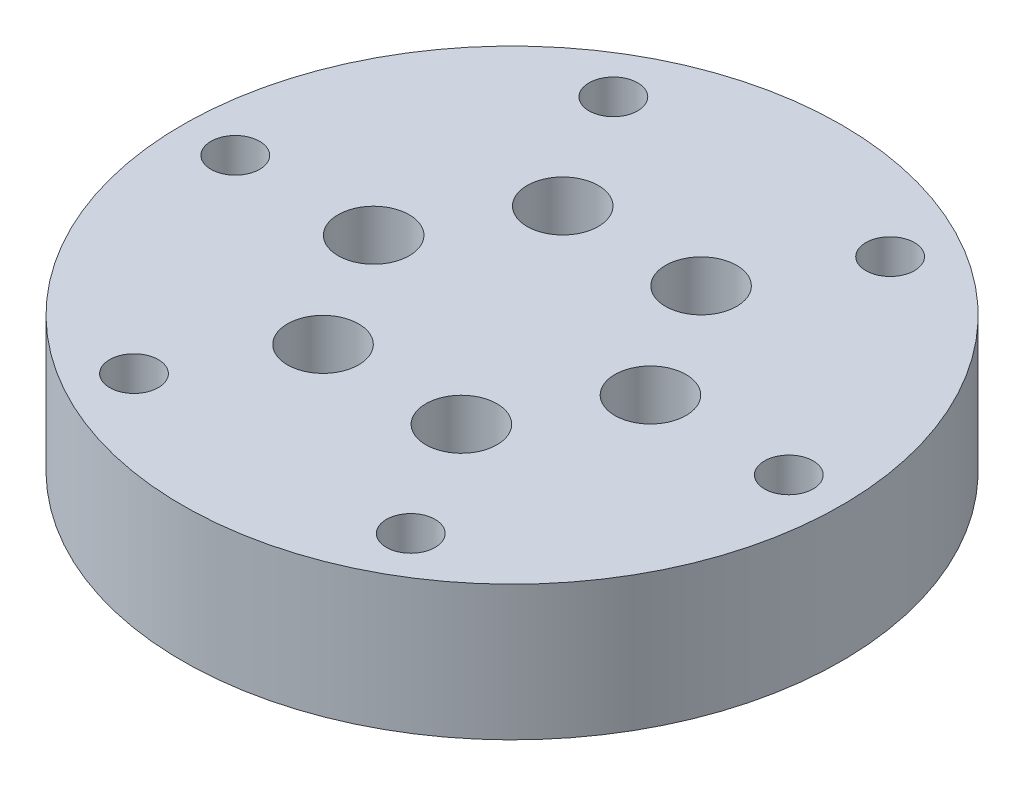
ISO-10303-21;
HEADER;
FILE_DESCRIPTION(('STEP AP214'),'2;1');
FILE_NAME('part.step','',(''),(''),'','','');
FILE_SCHEMA(('AUTOMOTIVE_DESIGN { 1 0 10303 214 1 1 1 1 }'));
ENDSEC;
DATA;
#1=APPLICATION_CONTEXT('core data for automotive mechanical design processes');
#2=APPLICATION_PROTOCOL_DEFINITION('international standard','automotive_design',2000,#1);
#3=PRODUCT_CONTEXT('',#1,'mechanical');
#4=PRODUCT('Part','Part','',(#3));
#5=PRODUCT_RELATED_PRODUCT_CATEGORY('part','',(#4));
#6=PRODUCT_DEFINITION_FORMATION('','',#4);
#7=PRODUCT_DEFINITION_CONTEXT('part definition',#1,'design');
#8=PRODUCT_DEFINITION('design','',#6,#7);
#9=PRODUCT_DEFINITION_SHAPE('','',#8);
#10=(LENGTH_UNIT() NAMED_UNIT(*) SI_UNIT(.MILLI.,.METRE.));
#11=(NAMED_UNIT(*) PLANE_ANGLE_UNIT() SI_UNIT($,.RADIAN.));
#12=(NAMED_UNIT(*) SI_UNIT($,.STERADIAN.) SOLID_ANGLE_UNIT());
#13=UNCERTAINTY_MEASURE_WITH_UNIT(LENGTH_MEASURE(1.E-05),#10,'distance_accuracy_value','');
#14=(GEOMETRIC_REPRESENTATION_CONTEXT(3) GLOBAL_UNCERTAINTY_ASSIGNED_CONTEXT((#13)) GLOBAL_UNIT_ASSIGNED_CONTEXT((#10,
#11,#12)) REPRESENTATION_CONTEXT('',''));
#15=CARTESIAN_POINT('',(0.,0.,0.));
#16=DIRECTION('',(0.,0.,1.));
#17=DIRECTION('',(1.,0.,0.));
#18=AXIS2_PLACEMENT_3D('',#15,#16,#17);
#19=CARTESIAN_POINT('',(29.329393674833,109.652959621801,50.8));
#20=DIRECTION('',(0.,1.,0.));
#21=DIRECTION('',(0.,0.,1.));
#22=AXIS2_PLACEMENT_3D('',#19,#20,#21);
#23=CYLINDRICAL_SURFACE('',#22,9.92187500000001);
#24=CARTESIAN_POINT('',(29.329393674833,137.716260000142,50.8));
#25=DIRECTION('',(0.,-1.,0.));
#26=DIRECTION('',(0.,0.,-1.));
#27=AXIS2_PLACEMENT_3D('',#24,#25,#26);
#28=CIRCLE('',#27,9.92187500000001);
#29=CARTESIAN_POINT('',(29.329393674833,137.716260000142,40.878125));
#30=VERTEX_POINT('',#29);
#31=EDGE_CURVE('E108',#30,#30,#28,.F.);
#32=ORIENTED_EDGE('',*,*,#31,.F.);
#33=EDGE_LOOP('',(#32));
#34=FACE_BOUND('',#33,.T.);
#35=CARTESIAN_POINT('',(29.329393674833,166.291260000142,50.8));
#36=DIRECTION('',(0.,1.,0.));
#37=DIRECTION('',(0.,0.,1.));
#38=AXIS2_PLACEMENT_3D('',#35,#36,#37);
#39=CIRCLE('',#38,9.92187500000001);
#40=CARTESIAN_POINT('',(29.329393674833,166.291260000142,60.721875));
#41=VERTEX_POINT('',#40);
#42=EDGE_CURVE('E41',#41,#41,#39,.F.);
#43=ORIENTED_EDGE('',*,*,#42,.F.);
#44=EDGE_LOOP('',(#43));
#45=FACE_BOUND('',#44,.T.);
#46=ADVANCED_FACE('F37',(#34,#45),#23,.F.);
#47=CARTESIAN_POINT('',(-29.329393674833,109.652959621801,50.8));
#48=DIRECTION('',(0.,1.,0.));
#49=DIRECTION('',(0.,0.,1.));
#50=AXIS2_PLACEMENT_3D('',#47,#48,#49);
#51=CYLINDRICAL_SURFACE('',#50,9.921875);
#52=CARTESIAN_POINT('',(-29.329393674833,137.716260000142,50.8));
#53=DIRECTION('',(0.,-1.,0.));
#54=DIRECTION('',(0.,0.,-1.));
#55=AXIS2_PLACEMENT_3D('',#52,#53,#54);
#56=CIRCLE('',#55,9.921875);
#57=CARTESIAN_POINT('',(-29.329393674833,137.716260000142,40.878125));
#58=VERTEX_POINT('',#57);
#59=EDGE_CURVE('E114',#58,#58,#56,.F.);
#60=ORIENTED_EDGE('',*,*,#59,.F.);
#61=EDGE_LOOP('',(#60));
#62=FACE_BOUND('',#61,.T.);
#63=CARTESIAN_POINT('',(-29.329393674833,166.291260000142,50.8));
#64=DIRECTION('',(0.,1.,0.));
#65=DIRECTION('',(0.,0.,1.));
#66=AXIS2_PLACEMENT_3D('',#63,#64,#65);
#67=CIRCLE('',#66,9.921875);
#68=CARTESIAN_POINT('',(-29.329393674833,166.291260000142,60.721875));
#69=VERTEX_POINT('',#68);
#70=EDGE_CURVE('E66',#69,#69,#67,.F.);
#71=ORIENTED_EDGE('',*,*,#70,.F.);
#72=EDGE_LOOP('',(#71));
#73=FACE_BOUND('',#72,.T.);
#74=ADVANCED_FACE('F181',(#62,#73),#51,.F.);
#75=CARTESIAN_POINT('',(-29.329393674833,109.652959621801,-50.8));
#76=DIRECTION('',(0.,1.,0.));
#77=DIRECTION('',(0.,0.,1.));
#78=AXIS2_PLACEMENT_3D('',#75,#76,#77);
#79=CYLINDRICAL_SURFACE('',#78,9.921875);
#80=CARTESIAN_POINT('',(-29.329393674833,137.716260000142,-50.8));
#81=DIRECTION('',(0.,-1.,0.));
#82=DIRECTION('',(0.,0.,-1.));
#83=AXIS2_PLACEMENT_3D('',#80,#81,#82);
#84=CIRCLE('',#83,9.921875);
#85=CARTESIAN_POINT('',(-29.329393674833,137.716260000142,-60.721875));
#86=VERTEX_POINT('',#85);
#87=EDGE_CURVE('E117',#86,#86,#84,.F.);
#88=ORIENTED_EDGE('',*,*,#87,.F.);
#89=EDGE_LOOP('',(#88));
#90=FACE_BOUND('',#89,.T.);
#91=CARTESIAN_POINT('',(-29.329393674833,166.291260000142,-50.8));
#92=DIRECTION('',(0.,1.,0.));
#93=DIRECTION('',(0.,0.,1.));
#94=AXIS2_PLACEMENT_3D('',#91,#92,#93);
#95=CIRCLE('',#94,9.921875);
#96=CARTESIAN_POINT('',(-29.329393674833,166.291260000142,-40.878125));
#97=VERTEX_POINT('',#96);
#98=EDGE_CURVE('E64',#97,#97,#95,.F.);
#99=ORIENTED_EDGE('',*,*,#98,.F.);
#100=EDGE_LOOP('',(#99));
#101=FACE_BOUND('',#100,.T.);
#102=ADVANCED_FACE('F187',(#90,#101),#79,.F.);
#103=CARTESIAN_POINT('',(-58.658787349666,109.652959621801,0.));
#104=DIRECTION('',(0.,1.,0.));
#105=DIRECTION('',(0.,0.,1.));
#106=AXIS2_PLACEMENT_3D('',#103,#104,#105);
#107=CYLINDRICAL_SURFACE('',#106,9.921875);
#108=CARTESIAN_POINT('',(-58.658787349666,137.716260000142,0.));
#109=DIRECTION('',(0.,-1.,0.));
#110=DIRECTION('',(0.,0.,-1.));
#111=AXIS2_PLACEMENT_3D('',#108,#109,#110);
#112=CIRCLE('',#111,9.921875);
#113=CARTESIAN_POINT('',(-58.658787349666,137.716260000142,-9.92187500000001));
#114=VERTEX_POINT('',#113);
#115=EDGE_CURVE('E111',#114,#114,#112,.F.);
#116=ORIENTED_EDGE('',*,*,#115,.F.);
#117=EDGE_LOOP('',(#116));
#118=FACE_BOUND('',#117,.T.);
#119=CARTESIAN_POINT('',(-58.658787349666,166.291260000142,0.));
#120=DIRECTION('',(0.,1.,0.));
#121=DIRECTION('',(0.,0.,1.));
#122=AXIS2_PLACEMENT_3D('',#119,#120,#121);
#123=CIRCLE('',#122,9.921875);
#124=CARTESIAN_POINT('',(-58.658787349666,166.291260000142,9.921875));
#125=VERTEX_POINT('',#124);
#126=EDGE_CURVE('E61',#125,#125,#123,.F.);
#127=ORIENTED_EDGE('',*,*,#126,.F.);
#128=EDGE_LOOP('',(#127));
#129=FACE_BOUND('',#128,.T.);
#130=ADVANCED_FACE('F198',(#118,#129),#107,.F.);
#131=CARTESIAN_POINT('',(29.329393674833,109.652959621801,-50.8));
#132=DIRECTION('',(0.,1.,0.));
#133=DIRECTION('',(0.,0.,1.));
#134=AXIS2_PLACEMENT_3D('',#131,#132,#133);
#135=CYLINDRICAL_SURFACE('',#134,9.92187500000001);
#136=CARTESIAN_POINT('',(29.329393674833,137.716260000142,-50.8));
#137=DIRECTION('',(0.,-1.,0.));
#138=DIRECTION('',(0.,0.,-1.));
#139=AXIS2_PLACEMENT_3D('',#136,#137,#138);
#140=CIRCLE('',#139,9.92187500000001);
#141=CARTESIAN_POINT('',(29.329393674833,137.716260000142,-60.721875));
#142=VERTEX_POINT('',#141);
#143=EDGE_CURVE('E103',#142,#142,#140,.F.);
#144=ORIENTED_EDGE('',*,*,#143,.F.);
#145=EDGE_LOOP('',(#144));
#146=FACE_BOUND('',#145,.T.);
#147=CARTESIAN_POINT('',(29.329393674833,166.291260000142,-50.8));
#148=DIRECTION('',(0.,1.,0.));
#149=DIRECTION('',(0.,0.,1.));
#150=AXIS2_PLACEMENT_3D('',#147,#148,#149);
#151=CIRCLE('',#150,9.92187500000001);
#152=CARTESIAN_POINT('',(29.329393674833,166.291260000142,-40.878125));
#153=VERTEX_POINT('',#152);
#154=EDGE_CURVE('E57',#153,#153,#151,.F.);
#155=ORIENTED_EDGE('',*,*,#154,.F.);
#156=EDGE_LOOP('',(#155));
#157=FACE_BOUND('',#156,.T.);
#158=ADVANCED_FACE('F193',(#146,#157),#135,.F.);
#159=CARTESIAN_POINT('',(58.658787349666,109.652959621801,0.));
#160=DIRECTION('',(0.,1.,0.));
#161=DIRECTION('',(0.,0.,1.));
#162=AXIS2_PLACEMENT_3D('',#159,#160,#161);
#163=CYLINDRICAL_SURFACE('',#162,9.92187500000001);
#164=CARTESIAN_POINT('',(58.658787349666,137.716260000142,0.));
#165=DIRECTION('',(0.,-1.,0.));
#166=DIRECTION('',(0.,0.,-1.));
#167=AXIS2_PLACEMENT_3D('',#164,#165,#166);
#168=CIRCLE('',#167,9.92187500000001);
#169=CARTESIAN_POINT('',(58.658787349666,137.716260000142,-9.92187500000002));
#170=VERTEX_POINT('',#169);
#171=EDGE_CURVE('E104',#170,#170,#168,.F.);
#172=ORIENTED_EDGE('',*,*,#171,.F.);
#173=EDGE_LOOP('',(#172));
#174=FACE_BOUND('',#173,.T.);
#175=CARTESIAN_POINT('',(58.658787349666,166.291260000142,0.));
#176=DIRECTION('',(0.,1.,0.));
#177=DIRECTION('',(0.,0.,1.));
#178=AXIS2_PLACEMENT_3D('',#175,#176,#177);
#179=CIRCLE('',#178,9.92187500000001);
#180=CARTESIAN_POINT('',(58.658787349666,166.291260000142,9.921875));
#181=VERTEX_POINT('',#180);
#182=EDGE_CURVE('E54',#181,#181,#179,.F.);
#183=ORIENTED_EDGE('',*,*,#182,.F.);
#184=EDGE_LOOP('',(#183));
#185=FACE_BOUND('',#184,.T.);
#186=ADVANCED_FACE('F150',(#174,#185),#163,.F.);
#187=CARTESIAN_POINT('',(0.,137.716260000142,0.));
#188=DIRECTION('',(0.,-1.,0.));
#189=DIRECTION('',(0.,0.,-1.));
#190=AXIS2_PLACEMENT_3D('',#187,#188,#189);
#191=CYLINDRICAL_SURFACE('',#190,139.7);
#192=CARTESIAN_POINT('',(0.,188.516260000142,0.));
#193=DIRECTION('',(0.,-1.,0.));
#194=DIRECTION('',(0.,0.,-1.));
#195=AXIS2_PLACEMENT_3D('',#192,#193,#194);
#196=CIRCLE('',#195,139.7);
#197=CARTESIAN_POINT('',(0.,188.516260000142,-139.7));
#198=VERTEX_POINT('',#197);
#199=EDGE_CURVE('E45',#198,#198,#196,.T.);
#200=ORIENTED_EDGE('',*,*,#199,.T.);
#201=EDGE_LOOP('',(#200));
#202=FACE_BOUND('',#201,.T.);
#203=CARTESIAN_POINT('',(0.,131.366260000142,0.));
#204=DIRECTION('',(0.,-1.,0.));
#205=DIRECTION('',(0.,0.,-1.));
#206=AXIS2_PLACEMENT_3D('',#203,#204,#205);
#207=CIRCLE('',#206,139.7);
#208=CARTESIAN_POINT('',(0.,131.366260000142,-139.7));
#209=VERTEX_POINT('',#208);
#210=EDGE_CURVE('E91',#209,#209,#207,.T.);
#211=ORIENTED_EDGE('',*,*,#210,.F.);
#212=EDGE_LOOP('',(#211));
#213=FACE_BOUND('',#212,.T.);
#214=ADVANCED_FACE('F39',(#202,#213),#191,.T.);
#215=CARTESIAN_POINT('',(0.,188.516260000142,0.));
#216=DIRECTION('',(0.,-1.,0.));
#217=DIRECTION('',(0.,0.,-1.));
#218=AXIS2_PLACEMENT_3D('',#215,#216,#217);
#219=PLANE('',#218);
#220=CARTESIAN_POINT('',(29.329393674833,188.516260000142,50.8));
#221=DIRECTION('',(0.,1.,0.));
#222=DIRECTION('',(0.,0.,1.));
#223=AXIS2_PLACEMENT_3D('',#220,#221,#222);
#224=CIRCLE('',#223,15.08125);
#225=CARTESIAN_POINT('',(29.329393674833,188.516260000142,65.88125));
#226=VERTEX_POINT('',#225);
#227=EDGE_CURVE('E348',#226,#226,#224,.T.);
#228=ORIENTED_EDGE('',*,*,#227,.F.);
#229=EDGE_LOOP('',(#228));
#230=FACE_BOUND('',#229,.T.);
#231=CARTESIAN_POINT('',(-29.329393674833,188.516260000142,50.8));
#232=DIRECTION('',(0.,1.,0.));
#233=DIRECTION('',(0.,0.,1.));
#234=AXIS2_PLACEMENT_3D('',#231,#232,#233);
#235=CIRCLE('',#234,15.08125);
#236=CARTESIAN_POINT('',(-29.329393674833,188.516260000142,65.88125));
#237=VERTEX_POINT('',#236);
#238=EDGE_CURVE('E326',#237,#237,#235,.T.);
#239=ORIENTED_EDGE('',*,*,#238,.F.);
#240=EDGE_LOOP('',(#239));
#241=FACE_BOUND('',#240,.T.);
#242=CARTESIAN_POINT('',(-58.658787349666,188.516260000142,0.));
#243=DIRECTION('',(0.,1.,0.));
#244=DIRECTION('',(0.,0.,1.));
#245=AXIS2_PLACEMENT_3D('',#242,#243,#244);
#246=CIRCLE('',#245,15.08125);
#247=CARTESIAN_POINT('',(-58.658787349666,188.516260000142,15.08125));
#248=VERTEX_POINT('',#247);
#249=EDGE_CURVE('E327',#248,#248,#246,.T.);
#250=ORIENTED_EDGE('',*,*,#249,.F.);
#251=EDGE_LOOP('',(#250));
#252=FACE_BOUND('',#251,.T.);
#253=CARTESIAN_POINT('',(-29.329393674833,188.516260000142,-50.8));
#254=DIRECTION('',(0.,1.,0.));
#255=DIRECTION('',(0.,0.,1.));
#256=AXIS2_PLACEMENT_3D('',#253,#254,#255);
#257=CIRCLE('',#256,15.08125);
#258=CARTESIAN_POINT('',(-29.329393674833,188.516260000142,-35.71875));
#259=VERTEX_POINT('',#258);
#260=EDGE_CURVE('E338',#259,#259,#257,.T.);
#261=ORIENTED_EDGE('',*,*,#260,.F.);
#262=EDGE_LOOP('',(#261));
#263=FACE_BOUND('',#262,.T.);
#264=CARTESIAN_POINT('',(29.329393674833,188.516260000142,-50.8));
#265=DIRECTION('',(0.,1.,0.));
#266=DIRECTION('',(0.,0.,1.));
#267=AXIS2_PLACEMENT_3D('',#264,#265,#266);
#268=CIRCLE('',#267,15.08125);
#269=CARTESIAN_POINT('',(29.329393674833,188.516260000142,-35.71875));
#270=VERTEX_POINT('',#269);
#271=EDGE_CURVE('E354',#270,#270,#268,.T.);
#272=ORIENTED_EDGE('',*,*,#271,.F.);
#273=EDGE_LOOP('',(#272));
#274=FACE_BOUND('',#273,.T.);
#275=CARTESIAN_POINT('',(58.658787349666,188.516260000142,0.));
#276=DIRECTION('',(0.,1.,0.));
#277=DIRECTION('',(0.,0.,1.));
#278=AXIS2_PLACEMENT_3D('',#275,#276,#277);
#279=CIRCLE('',#278,15.08125);
#280=CARTESIAN_POINT('',(58.658787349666,188.516260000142,15.08125));
#281=VERTEX_POINT('',#280);
#282=EDGE_CURVE('E83',#281,#281,#279,.T.);
#283=ORIENTED_EDGE('',*,*,#282,.F.);
#284=EDGE_LOOP('',(#283));
#285=FACE_BOUND('',#284,.T.);
#286=CARTESIAN_POINT('',(58.658787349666,188.516260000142,-101.6));
#287=DIRECTION('',(0.,-1.,0.));
#288=DIRECTION('',(0.,0.,-1.));
#289=AXIS2_PLACEMENT_3D('',#286,#287,#288);
#290=CIRCLE('',#289,10.31875);
#291=CARTESIAN_POINT('',(58.658787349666,188.516260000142,-111.91875));
#292=VERTEX_POINT('',#291);
#293=EDGE_CURVE('E107',#292,#292,#290,.F.);
#294=ORIENTED_EDGE('',*,*,#293,.F.);
#295=EDGE_LOOP('',(#294));
#296=FACE_BOUND('',#295,.T.);
#297=CARTESIAN_POINT('',(117.317574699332,188.516260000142,0.));
#298=DIRECTION('',(0.,-1.,0.));
#299=DIRECTION('',(0.,0.,-1.));
#300=AXIS2_PLACEMENT_3D('',#297,#298,#299);
#301=CIRCLE('',#300,10.31875);
#302=CARTESIAN_POINT('',(117.317574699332,188.516260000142,-10.31875));
#303=VERTEX_POINT('',#302);
#304=EDGE_CURVE('E131',#303,#303,#301,.F.);
#305=ORIENTED_EDGE('',*,*,#304,.F.);
#306=EDGE_LOOP('',(#305));
#307=FACE_BOUND('',#306,.T.);
#308=CARTESIAN_POINT('',(58.658787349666,188.516260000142,101.6));
#309=DIRECTION('',(0.,-1.,0.));
#310=DIRECTION('',(0.,0.,-1.));
#311=AXIS2_PLACEMENT_3D('',#308,#309,#310);
#312=CIRCLE('',#311,10.31875);
#313=CARTESIAN_POINT('',(58.658787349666,188.516260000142,91.28125));
#314=VERTEX_POINT('',#313);
#315=EDGE_CURVE('E128',#314,#314,#312,.F.);
#316=ORIENTED_EDGE('',*,*,#315,.F.);
#317=EDGE_LOOP('',(#316));
#318=FACE_BOUND('',#317,.T.);
#319=CARTESIAN_POINT('',(-58.658787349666,188.516260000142,101.6));
#320=DIRECTION('',(0.,-1.,0.));
#321=DIRECTION('',(0.,0.,-1.));
#322=AXIS2_PLACEMENT_3D('',#319,#320,#321);
#323=CIRCLE('',#322,10.31875);
#324=CARTESIAN_POINT('',(-58.658787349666,188.516260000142,91.28125));
#325=VERTEX_POINT('',#324);
#326=EDGE_CURVE('E125',#325,#325,#323,.F.);
#327=ORIENTED_EDGE('',*,*,#326,.F.);
#328=EDGE_LOOP('',(#327));
#329=FACE_BOUND('',#328,.T.);
#330=CARTESIAN_POINT('',(-117.317574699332,188.516260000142,0.));
#331=DIRECTION('',(0.,-1.,0.));
#332=DIRECTION('',(0.,0.,-1.));
#333=AXIS2_PLACEMENT_3D('',#330,#331,#332);
#334=CIRCLE('',#333,10.31875);
#335=CARTESIAN_POINT('',(-117.317574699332,188.516260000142,-10.31875));
#336=VERTEX_POINT('',#335);
#337=EDGE_CURVE('E122',#336,#336,#334,.F.);
#338=ORIENTED_EDGE('',*,*,#337,.F.);
#339=EDGE_LOOP('',(#338));
#340=FACE_BOUND('',#339,.T.);
#341=CARTESIAN_POINT('',(-58.658787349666,188.516260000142,-101.6));
#342=DIRECTION('',(0.,-1.,0.));
#343=DIRECTION('',(0.,0.,-1.));
#344=AXIS2_PLACEMENT_3D('',#341,#342,#343);
#345=CIRCLE('',#344,10.31875);
#346=CARTESIAN_POINT('',(-58.658787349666,188.516260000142,-111.91875));
#347=VERTEX_POINT('',#346);
#348=EDGE_CURVE('E50',#347,#347,#345,.F.);
#349=ORIENTED_EDGE('',*,*,#348,.F.);
#350=EDGE_LOOP('',(#349));
#351=FACE_BOUND('',#350,.T.);
#352=ORIENTED_EDGE('',*,*,#199,.F.);
#353=EDGE_LOOP('',(#352));
#354=FACE_BOUND('',#353,.T.);
#355=ADVANCED_FACE('F141',(#230,#241,#252,#263,#274,#285,#296,#307,#318,#329,#340,#351,#354),
#219,.F.);
#356=CARTESIAN_POINT('',(0.,137.716260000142,0.));
#357=DIRECTION('',(0.,-1.,0.));
#358=DIRECTION('',(0.,0.,-1.));
#359=AXIS2_PLACEMENT_3D('',#356,#357,#358);
#360=PLANE('',#359);
#361=CARTESIAN_POINT('',(0.,137.716260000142,0.));
#362=DIRECTION('',(0.,-1.,0.));
#363=DIRECTION('',(0.,0.,-1.));
#364=AXIS2_PLACEMENT_3D('',#361,#362,#363);
#365=CIRCLE('',#364,76.327);
#366=CARTESIAN_POINT('',(0.,137.716260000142,-76.327));
#367=VERTEX_POINT('',#366);
#368=EDGE_CURVE('E10',#367,#367,#365,.F.);
#369=ORIENTED_EDGE('',*,*,#368,.F.);
#370=EDGE_LOOP('',(#369));
#371=FACE_BOUND('',#370,.T.);
#372=ORIENTED_EDGE('',*,*,#171,.T.);
#373=EDGE_LOOP('',(#372));
#374=FACE_BOUND('',#373,.T.);
#375=ORIENTED_EDGE('',*,*,#143,.T.);
#376=EDGE_LOOP('',(#375));
#377=FACE_BOUND('',#376,.T.);
#378=ORIENTED_EDGE('',*,*,#115,.T.);
#379=EDGE_LOOP('',(#378));
#380=FACE_BOUND('',#379,.T.);
#381=ORIENTED_EDGE('',*,*,#87,.T.);
#382=EDGE_LOOP('',(#381));
#383=FACE_BOUND('',#382,.T.);
#384=ORIENTED_EDGE('',*,*,#59,.T.);
#385=EDGE_LOOP('',(#384));
#386=FACE_BOUND('',#385,.T.);
#387=ORIENTED_EDGE('',*,*,#31,.T.);
#388=EDGE_LOOP('',(#387));
#389=FACE_BOUND('',#388,.T.);
#390=ADVANCED_FACE('F144',(#371,#374,#377,#380,#383,#386,#389),#360,.T.);
#391=CARTESIAN_POINT('',(-58.658787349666,217.702092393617,-101.6));
#392=DIRECTION('',(0.,-1.,0.));
#393=DIRECTION('',(0.,0.,-1.));
#394=AXIS2_PLACEMENT_3D('',#391,#392,#393);
#395=CYLINDRICAL_SURFACE('',#394,10.31875);
#396=ORIENTED_EDGE('',*,*,#348,.T.);
#397=EDGE_LOOP('',(#396));
#398=FACE_BOUND('',#397,.T.);
#399=CARTESIAN_POINT('',(-58.658787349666,131.366260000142,-101.6));
#400=DIRECTION('',(0.,-1.,0.));
#401=DIRECTION('',(0.,0.,-1.));
#402=AXIS2_PLACEMENT_3D('',#399,#400,#401);
#403=CIRCLE('',#402,10.31875);
#404=CARTESIAN_POINT('',(-58.658787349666,131.366260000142,-111.91875));
#405=VERTEX_POINT('',#404);
#406=EDGE_CURVE('E88',#405,#405,#403,.F.);
#407=ORIENTED_EDGE('',*,*,#406,.F.);
#408=EDGE_LOOP('',(#407));
#409=FACE_BOUND('',#408,.T.);
#410=ADVANCED_FACE('F138',(#398,#409),#395,.F.);
#411=CARTESIAN_POINT('',(-117.317574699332,217.702092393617,0.));
#412=DIRECTION('',(0.,-1.,0.));
#413=DIRECTION('',(0.,0.,-1.));
#414=AXIS2_PLACEMENT_3D('',#411,#412,#413);
#415=CYLINDRICAL_SURFACE('',#414,10.31875);
#416=ORIENTED_EDGE('',*,*,#337,.T.);
#417=EDGE_LOOP('',(#416));
#418=FACE_BOUND('',#417,.T.);
#419=CARTESIAN_POINT('',(-117.317574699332,131.366260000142,0.));
#420=DIRECTION('',(0.,-1.,0.));
#421=DIRECTION('',(0.,0.,-1.));
#422=AXIS2_PLACEMENT_3D('',#419,#420,#421);
#423=CIRCLE('',#422,10.31875);
#424=CARTESIAN_POINT('',(-117.317574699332,131.366260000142,-10.31875));
#425=VERTEX_POINT('',#424);
#426=EDGE_CURVE('E94',#425,#425,#423,.F.);
#427=ORIENTED_EDGE('',*,*,#426,.F.);
#428=EDGE_LOOP('',(#427));
#429=FACE_BOUND('',#428,.T.);
#430=ADVANCED_FACE('F203',(#418,#429),#415,.F.);
#431=CARTESIAN_POINT('',(-58.658787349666,217.702092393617,101.6));
#432=DIRECTION('',(0.,-1.,0.));
#433=DIRECTION('',(0.,0.,-1.));
#434=AXIS2_PLACEMENT_3D('',#431,#432,#433);
#435=CYLINDRICAL_SURFACE('',#434,10.31875);
#436=ORIENTED_EDGE('',*,*,#326,.T.);
#437=EDGE_LOOP('',(#436));
#438=FACE_BOUND('',#437,.T.);
#439=CARTESIAN_POINT('',(-58.658787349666,131.366260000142,101.6));
#440=DIRECTION('',(0.,-1.,0.));
#441=DIRECTION('',(0.,0.,-1.));
#442=AXIS2_PLACEMENT_3D('',#439,#440,#441);
#443=CIRCLE('',#442,10.31875);
#444=CARTESIAN_POINT('',(-58.658787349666,131.366260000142,91.28125));
#445=VERTEX_POINT('',#444);
#446=EDGE_CURVE('E80',#445,#445,#443,.F.);
#447=ORIENTED_EDGE('',*,*,#446,.F.);
#448=EDGE_LOOP('',(#447));
#449=FACE_BOUND('',#448,.T.);
#450=ADVANCED_FACE('F206',(#438,#449),#435,.F.);
#451=CARTESIAN_POINT('',(58.658787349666,217.702092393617,101.6));
#452=DIRECTION('',(0.,-1.,0.));
#453=DIRECTION('',(0.,0.,-1.));
#454=AXIS2_PLACEMENT_3D('',#451,#452,#453);
#455=CYLINDRICAL_SURFACE('',#454,10.31875);
#456=ORIENTED_EDGE('',*,*,#315,.T.);
#457=EDGE_LOOP('',(#456));
#458=FACE_BOUND('',#457,.T.);
#459=CARTESIAN_POINT('',(58.658787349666,131.366260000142,101.6));
#460=DIRECTION('',(0.,-1.,0.));
#461=DIRECTION('',(0.,0.,-1.));
#462=AXIS2_PLACEMENT_3D('',#459,#460,#461);
#463=CIRCLE('',#462,10.31875);
#464=CARTESIAN_POINT('',(58.658787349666,131.366260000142,91.28125));
#465=VERTEX_POINT('',#464);
#466=EDGE_CURVE('E97',#465,#465,#463,.F.);
#467=ORIENTED_EDGE('',*,*,#466,.F.);
#468=EDGE_LOOP('',(#467));
#469=FACE_BOUND('',#468,.T.);
#470=ADVANCED_FACE('F176',(#458,#469),#455,.F.);
#471=CARTESIAN_POINT('',(117.317574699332,217.702092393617,0.));
#472=DIRECTION('',(0.,-1.,0.));
#473=DIRECTION('',(0.,0.,-1.));
#474=AXIS2_PLACEMENT_3D('',#471,#472,#473);
#475=CYLINDRICAL_SURFACE('',#474,10.31875);
#476=ORIENTED_EDGE('',*,*,#304,.T.);
#477=EDGE_LOOP('',(#476));
#478=FACE_BOUND('',#477,.T.);
#479=CARTESIAN_POINT('',(117.317574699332,131.366260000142,0.));
#480=DIRECTION('',(0.,-1.,0.));
#481=DIRECTION('',(0.,0.,-1.));
#482=AXIS2_PLACEMENT_3D('',#479,#480,#481);
#483=CIRCLE('',#482,10.31875);
#484=CARTESIAN_POINT('',(117.317574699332,131.366260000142,-10.31875));
#485=VERTEX_POINT('',#484);
#486=EDGE_CURVE('E75',#485,#485,#483,.F.);
#487=ORIENTED_EDGE('',*,*,#486,.F.);
#488=EDGE_LOOP('',(#487));
#489=FACE_BOUND('',#488,.T.);
#490=ADVANCED_FACE('F168',(#478,#489),#475,.F.);
#491=CARTESIAN_POINT('',(58.658787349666,217.702092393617,-101.6));
#492=DIRECTION('',(0.,-1.,0.));
#493=DIRECTION('',(0.,0.,-1.));
#494=AXIS2_PLACEMENT_3D('',#491,#492,#493);
#495=CYLINDRICAL_SURFACE('',#494,10.31875);
#496=ORIENTED_EDGE('',*,*,#293,.T.);
#497=EDGE_LOOP('',(#496));
#498=FACE_BOUND('',#497,.T.);
#499=CARTESIAN_POINT('',(58.658787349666,131.366260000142,-101.6));
#500=DIRECTION('',(0.,-1.,0.));
#501=DIRECTION('',(0.,0.,-1.));
#502=AXIS2_PLACEMENT_3D('',#499,#500,#501);
#503=CIRCLE('',#502,10.31875);
#504=CARTESIAN_POINT('',(58.658787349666,131.366260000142,-111.91875));
#505=VERTEX_POINT('',#504);
#506=EDGE_CURVE('E100',#505,#505,#503,.F.);
#507=ORIENTED_EDGE('',*,*,#506,.F.);
#508=EDGE_LOOP('',(#507));
#509=FACE_BOUND('',#508,.T.);
#510=ADVANCED_FACE('F166',(#498,#509),#495,.F.);
#511=CARTESIAN_POINT('',(0.,131.366260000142,0.));
#512=DIRECTION('',(0.,1.,0.));
#513=DIRECTION('',(0.,0.,1.));
#514=AXIS2_PLACEMENT_3D('',#511,#512,#513);
#515=CYLINDRICAL_SURFACE('',#514,76.327);
#516=CARTESIAN_POINT('',(0.,131.366260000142,0.));
#517=DIRECTION('',(0.,-1.,0.));
#518=DIRECTION('',(0.,0.,-1.));
#519=AXIS2_PLACEMENT_3D('',#516,#517,#518);
#520=CIRCLE('',#519,76.327);
#521=CARTESIAN_POINT('',(0.,131.366260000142,-76.327));
#522=VERTEX_POINT('',#521);
#523=EDGE_CURVE('E71',#522,#522,#520,.T.);
#524=ORIENTED_EDGE('',*,*,#523,.T.);
#525=EDGE_LOOP('',(#524));
#526=FACE_BOUND('',#525,.T.);
#527=ORIENTED_EDGE('',*,*,#368,.T.);
#528=EDGE_LOOP('',(#527));
#529=FACE_BOUND('',#528,.T.);
#530=ADVANCED_FACE('F157',(#526,#529),#515,.F.);
#531=CARTESIAN_POINT('',(0.,131.366260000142,0.));
#532=DIRECTION('',(0.,-1.,0.));
#533=DIRECTION('',(0.,0.,-1.));
#534=AXIS2_PLACEMENT_3D('',#531,#532,#533);
#535=PLANE('',#534);
#536=ORIENTED_EDGE('',*,*,#523,.F.);
#537=EDGE_LOOP('',(#536));
#538=FACE_BOUND('',#537,.T.);
#539=ORIENTED_EDGE('',*,*,#486,.T.);
#540=EDGE_LOOP('',(#539));
#541=FACE_BOUND('',#540,.T.);
#542=ORIENTED_EDGE('',*,*,#446,.T.);
#543=EDGE_LOOP('',(#542));
#544=FACE_BOUND('',#543,.T.);
#545=ORIENTED_EDGE('',*,*,#406,.T.);
#546=EDGE_LOOP('',(#545));
#547=FACE_BOUND('',#546,.T.);
#548=ORIENTED_EDGE('',*,*,#210,.T.);
#549=EDGE_LOOP('',(#548));
#550=FACE_BOUND('',#549,.T.);
#551=ORIENTED_EDGE('',*,*,#426,.T.);
#552=EDGE_LOOP('',(#551));
#553=FACE_BOUND('',#552,.T.);
#554=ORIENTED_EDGE('',*,*,#466,.T.);
#555=EDGE_LOOP('',(#554));
#556=FACE_BOUND('',#555,.T.);
#557=ORIENTED_EDGE('',*,*,#506,.T.);
#558=EDGE_LOOP('',(#557));
#559=FACE_BOUND('',#558,.T.);
#560=ADVANCED_FACE('F153',(#538,#541,#544,#547,#550,#553,#556,#559),#535,.T.);
#561=CARTESIAN_POINT('',(58.658787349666,166.291260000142,0.));
#562=DIRECTION('',(0.,1.,0.));
#563=DIRECTION('',(0.,0.,1.));
#564=AXIS2_PLACEMENT_3D('',#561,#562,#563);
#565=PLANE('',#564);
#566=CARTESIAN_POINT('',(58.658787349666,166.291260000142,0.));
#567=DIRECTION('',(0.,1.,0.));
#568=DIRECTION('',(0.,0.,1.));
#569=AXIS2_PLACEMENT_3D('',#566,#567,#568);
#570=CIRCLE('',#569,15.08125);
#571=CARTESIAN_POINT('',(58.658787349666,166.291260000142,15.08125));
#572=VERTEX_POINT('',#571);
#573=EDGE_CURVE('E58',#572,#572,#570,.T.);
#574=ORIENTED_EDGE('',*,*,#573,.T.);
#575=EDGE_LOOP('',(#574));
#576=FACE_BOUND('',#575,.T.);
#577=ORIENTED_EDGE('',*,*,#182,.T.);
#578=EDGE_LOOP('',(#577));
#579=FACE_BOUND('',#578,.T.);
#580=ADVANCED_FACE('F156',(#576,#579),#565,.T.);
#581=CARTESIAN_POINT('',(58.658787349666,166.291260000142,0.));
#582=DIRECTION('',(0.,1.,0.));
#583=DIRECTION('',(0.,0.,1.));
#584=AXIS2_PLACEMENT_3D('',#581,#582,#583);
#585=CYLINDRICAL_SURFACE('',#584,15.08125);
#586=ORIENTED_EDGE('',*,*,#573,.F.);
#587=EDGE_LOOP('',(#586));
#588=FACE_BOUND('',#587,.T.);
#589=ORIENTED_EDGE('',*,*,#282,.T.);
#590=EDGE_LOOP('',(#589));
#591=FACE_BOUND('',#590,.T.);
#592=ADVANCED_FACE('F272',(#588,#591),#585,.F.);
#593=CARTESIAN_POINT('',(29.329393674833,166.291260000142,-50.8));
#594=DIRECTION('',(0.,1.,0.));
#595=DIRECTION('',(0.,0.,1.));
#596=AXIS2_PLACEMENT_3D('',#593,#594,#595);
#597=PLANE('',#596);
#598=CARTESIAN_POINT('',(29.329393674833,166.291260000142,-50.8));
#599=DIRECTION('',(0.,1.,0.));
#600=DIRECTION('',(0.,0.,1.));
#601=AXIS2_PLACEMENT_3D('',#598,#599,#600);
#602=CIRCLE('',#601,15.08125);
#603=CARTESIAN_POINT('',(29.329393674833,166.291260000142,-35.71875));
#604=VERTEX_POINT('',#603);
#605=EDGE_CURVE('E340',#604,#604,#602,.T.);
#606=ORIENTED_EDGE('',*,*,#605,.T.);
#607=EDGE_LOOP('',(#606));
#608=FACE_BOUND('',#607,.T.);
#609=ORIENTED_EDGE('',*,*,#154,.T.);
#610=EDGE_LOOP('',(#609));
#611=FACE_BOUND('',#610,.T.);
#612=ADVANCED_FACE('F275',(#608,#611),#597,.T.);
#613=CARTESIAN_POINT('',(29.329393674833,166.291260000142,-50.8));
#614=DIRECTION('',(0.,1.,0.));
#615=DIRECTION('',(0.,0.,1.));
#616=AXIS2_PLACEMENT_3D('',#613,#614,#615);
#617=CYLINDRICAL_SURFACE('',#616,15.08125);
#618=ORIENTED_EDGE('',*,*,#605,.F.);
#619=EDGE_LOOP('',(#618));
#620=FACE_BOUND('',#619,.T.);
#621=ORIENTED_EDGE('',*,*,#271,.T.);
#622=EDGE_LOOP('',(#621));
#623=FACE_BOUND('',#622,.T.);
#624=ADVANCED_FACE('F292',(#620,#623),#617,.F.);
#625=CARTESIAN_POINT('',(-58.658787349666,166.291260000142,0.));
#626=DIRECTION('',(0.,1.,0.));
#627=DIRECTION('',(0.,0.,1.));
#628=AXIS2_PLACEMENT_3D('',#625,#626,#627);
#629=PLANE('',#628);
#630=CARTESIAN_POINT('',(-58.658787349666,166.291260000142,0.));
#631=DIRECTION('',(0.,1.,0.));
#632=DIRECTION('',(0.,0.,1.));
#633=AXIS2_PLACEMENT_3D('',#630,#631,#632);
#634=CIRCLE('',#633,15.08125);
#635=CARTESIAN_POINT('',(-58.658787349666,166.291260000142,15.08125));
#636=VERTEX_POINT('',#635);
#637=EDGE_CURVE('E323',#636,#636,#634,.T.);
#638=ORIENTED_EDGE('',*,*,#637,.T.);
#639=EDGE_LOOP('',(#638));
#640=FACE_BOUND('',#639,.T.);
#641=ORIENTED_EDGE('',*,*,#126,.T.);
#642=EDGE_LOOP('',(#641));
#643=FACE_BOUND('',#642,.T.);
#644=ADVANCED_FACE('F264',(#640,#643),#629,.T.);
#645=CARTESIAN_POINT('',(-58.658787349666,166.291260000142,0.));
#646=DIRECTION('',(0.,1.,0.));
#647=DIRECTION('',(0.,0.,1.));
#648=AXIS2_PLACEMENT_3D('',#645,#646,#647);
#649=CYLINDRICAL_SURFACE('',#648,15.08125);
#650=ORIENTED_EDGE('',*,*,#637,.F.);
#651=EDGE_LOOP('',(#650));
#652=FACE_BOUND('',#651,.T.);
#653=ORIENTED_EDGE('',*,*,#249,.T.);
#654=EDGE_LOOP('',(#653));
#655=FACE_BOUND('',#654,.T.);
#656=ADVANCED_FACE('F254',(#652,#655),#649,.F.);
#657=CARTESIAN_POINT('',(-29.329393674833,166.291260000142,-50.8));
#658=DIRECTION('',(0.,1.,0.));
#659=DIRECTION('',(0.,0.,1.));
#660=AXIS2_PLACEMENT_3D('',#657,#658,#659);
#661=PLANE('',#660);
#662=CARTESIAN_POINT('',(-29.329393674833,166.291260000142,-50.8));
#663=DIRECTION('',(0.,1.,0.));
#664=DIRECTION('',(0.,0.,1.));
#665=AXIS2_PLACEMENT_3D('',#662,#663,#664);
#666=CIRCLE('',#665,15.08125);
#667=CARTESIAN_POINT('',(-29.329393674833,166.291260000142,-35.71875));
#668=VERTEX_POINT('',#667);
#669=EDGE_CURVE('E333',#668,#668,#666,.T.);
#670=ORIENTED_EDGE('',*,*,#669,.T.);
#671=EDGE_LOOP('',(#670));
#672=FACE_BOUND('',#671,.T.);
#673=ORIENTED_EDGE('',*,*,#98,.T.);
#674=EDGE_LOOP('',(#673));
#675=FACE_BOUND('',#674,.T.);
#676=ADVANCED_FACE('F251',(#672,#675),#661,.T.);
#677=CARTESIAN_POINT('',(-29.329393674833,166.291260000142,-50.8));
#678=DIRECTION('',(0.,1.,0.));
#679=DIRECTION('',(0.,0.,1.));
#680=AXIS2_PLACEMENT_3D('',#677,#678,#679);
#681=CYLINDRICAL_SURFACE('',#680,15.08125);
#682=ORIENTED_EDGE('',*,*,#669,.F.);
#683=EDGE_LOOP('',(#682));
#684=FACE_BOUND('',#683,.T.);
#685=ORIENTED_EDGE('',*,*,#260,.T.);
#686=EDGE_LOOP('',(#685));
#687=FACE_BOUND('',#686,.T.);
#688=ADVANCED_FACE('F253',(#684,#687),#681,.F.);
#689=CARTESIAN_POINT('',(-29.329393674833,166.291260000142,50.8));
#690=DIRECTION('',(0.,1.,0.));
#691=DIRECTION('',(0.,0.,1.));
#692=AXIS2_PLACEMENT_3D('',#689,#690,#691);
#693=PLANE('',#692);
#694=CARTESIAN_POINT('',(-29.329393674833,166.291260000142,50.8));
#695=DIRECTION('',(0.,1.,0.));
#696=DIRECTION('',(0.,0.,1.));
#697=AXIS2_PLACEMENT_3D('',#694,#695,#696);
#698=CIRCLE('',#697,15.08125);
#699=CARTESIAN_POINT('',(-29.329393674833,166.291260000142,65.88125));
#700=VERTEX_POINT('',#699);
#701=EDGE_CURVE('E330',#700,#700,#698,.T.);
#702=ORIENTED_EDGE('',*,*,#701,.T.);
#703=EDGE_LOOP('',(#702));
#704=FACE_BOUND('',#703,.T.);
#705=ORIENTED_EDGE('',*,*,#70,.T.);
#706=EDGE_LOOP('',(#705));
#707=FACE_BOUND('',#706,.T.);
#708=ADVANCED_FACE('F261',(#704,#707),#693,.T.);
#709=CARTESIAN_POINT('',(-29.329393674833,166.291260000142,50.8));
#710=DIRECTION('',(0.,1.,0.));
#711=DIRECTION('',(0.,0.,1.));
#712=AXIS2_PLACEMENT_3D('',#709,#710,#711);
#713=CYLINDRICAL_SURFACE('',#712,15.08125);
#714=ORIENTED_EDGE('',*,*,#701,.F.);
#715=EDGE_LOOP('',(#714));
#716=FACE_BOUND('',#715,.T.);
#717=ORIENTED_EDGE('',*,*,#238,.T.);
#718=EDGE_LOOP('',(#717));
#719=FACE_BOUND('',#718,.T.);
#720=ADVANCED_FACE('F306',(#716,#719),#713,.F.);
#721=CARTESIAN_POINT('',(29.329393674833,166.291260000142,50.8));
#722=DIRECTION('',(0.,1.,0.));
#723=DIRECTION('',(0.,0.,1.));
#724=AXIS2_PLACEMENT_3D('',#721,#722,#723);
#725=PLANE('',#724);
#726=CARTESIAN_POINT('',(29.329393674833,166.291260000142,50.8));
#727=DIRECTION('',(0.,1.,0.));
#728=DIRECTION('',(0.,0.,1.));
#729=AXIS2_PLACEMENT_3D('',#726,#727,#728);
#730=CIRCLE('',#729,15.08125);
#731=CARTESIAN_POINT('',(29.329393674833,166.291260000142,65.88125));
#732=VERTEX_POINT('',#731);
#733=EDGE_CURVE('E344',#732,#732,#730,.T.);
#734=ORIENTED_EDGE('',*,*,#733,.T.);
#735=EDGE_LOOP('',(#734));
#736=FACE_BOUND('',#735,.T.);
#737=ORIENTED_EDGE('',*,*,#42,.T.);
#738=EDGE_LOOP('',(#737));
#739=FACE_BOUND('',#738,.T.);
#740=ADVANCED_FACE('F302',(#736,#739),#725,.T.);
#741=CARTESIAN_POINT('',(29.329393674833,166.291260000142,50.8));
#742=DIRECTION('',(0.,1.,0.));
#743=DIRECTION('',(0.,0.,1.));
#744=AXIS2_PLACEMENT_3D('',#741,#742,#743);
#745=CYLINDRICAL_SURFACE('',#744,15.08125);
#746=ORIENTED_EDGE('',*,*,#733,.F.);
#747=EDGE_LOOP('',(#746));
#748=FACE_BOUND('',#747,.T.);
#749=ORIENTED_EDGE('',*,*,#227,.T.);
#750=EDGE_LOOP('',(#749));
#751=FACE_BOUND('',#750,.T.);
#752=ADVANCED_FACE('F305',(#748,#751),#745,.F.);
#753=CLOSED_SHELL('',(#46,#74,#102,#130,#158,#186,#214,#355,#390,#410,#430,#450,#470,#490,#510,
#530,#560,#580,#592,#612,#624,#644,#656,#676,#688,#708,#720,#740,#752));
#754=MANIFOLD_SOLID_BREP('B2',#753);
#755=ADVANCED_BREP_SHAPE_REPRESENTATION('',(#18,#754),#14);
#756=SHAPE_DEFINITION_REPRESENTATION(#9,#755);
ENDSEC;
END-ISO-10303-21;
